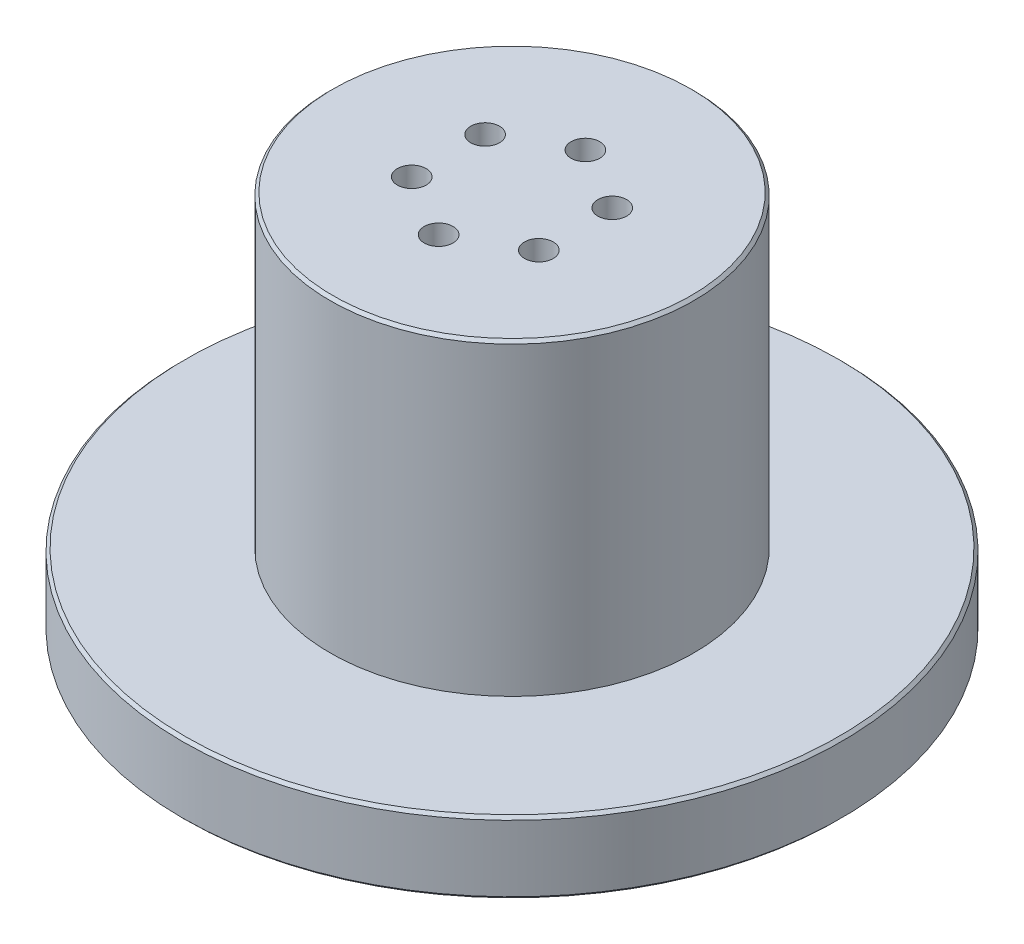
ISO-10303-21;
HEADER;
FILE_DESCRIPTION(('STEP AP214'),'2;1');
FILE_NAME('part.step','',(''),(''),'','','');
FILE_SCHEMA(('AUTOMOTIVE_DESIGN { 1 0 10303 214 1 1 1 1 }'));
ENDSEC;
DATA;
#1=APPLICATION_CONTEXT('core data for automotive mechanical design processes');
#2=APPLICATION_PROTOCOL_DEFINITION('international standard','automotive_design',2000,#1);
#3=PRODUCT_CONTEXT('',#1,'mechanical');
#4=PRODUCT('Part','Part','',(#3));
#5=PRODUCT_RELATED_PRODUCT_CATEGORY('part','',(#4));
#6=PRODUCT_DEFINITION_FORMATION('','',#4);
#7=PRODUCT_DEFINITION_CONTEXT('part definition',#1,'design');
#8=PRODUCT_DEFINITION('design','',#6,#7);
#9=PRODUCT_DEFINITION_SHAPE('','',#8);
#10=(LENGTH_UNIT() NAMED_UNIT(*) SI_UNIT(.MILLI.,.METRE.));
#11=(NAMED_UNIT(*) PLANE_ANGLE_UNIT() SI_UNIT($,.RADIAN.));
#12=(NAMED_UNIT(*) SI_UNIT($,.STERADIAN.) SOLID_ANGLE_UNIT());
#13=UNCERTAINTY_MEASURE_WITH_UNIT(LENGTH_MEASURE(1.E-05),#10,'distance_accuracy_value','');
#14=(GEOMETRIC_REPRESENTATION_CONTEXT(3) GLOBAL_UNCERTAINTY_ASSIGNED_CONTEXT((#13)) GLOBAL_UNIT_ASSIGNED_CONTEXT((#10,
#11,#12)) REPRESENTATION_CONTEXT('',''));
#15=CARTESIAN_POINT('',(0.,0.,0.));
#16=DIRECTION('',(0.,0.,1.));
#17=DIRECTION('',(1.,0.,0.));
#18=AXIS2_PLACEMENT_3D('',#15,#16,#17);
#19=CARTESIAN_POINT('',(0.,0.,0.));
#20=DIRECTION('',(0.,1.,0.));
#21=DIRECTION('',(0.,0.,1.));
#22=AXIS2_PLACEMENT_3D('',#19,#20,#21);
#23=PLANE('',#22);
#24=CARTESIAN_POINT('',(0.,0.,0.));
#25=DIRECTION('',(0.,1.,0.));
#26=DIRECTION('',(0.,0.,1.));
#27=AXIS2_PLACEMENT_3D('',#24,#25,#26);
#28=CIRCLE('',#27,56.75);
#29=CARTESIAN_POINT('',(0.,0.,56.75));
#30=VERTEX_POINT('',#29);
#31=EDGE_CURVE('E122',#30,#30,#28,.F.);
#32=ORIENTED_EDGE('',*,*,#31,.T.);
#33=EDGE_LOOP('',(#32));
#34=FACE_BOUND('',#33,.T.);
#35=ADVANCED_FACE('F38',(#34),#23,.F.);
#36=CARTESIAN_POINT('',(0.,-37.4668861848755,0.));
#37=DIRECTION('',(0.,-1.,0.));
#38=DIRECTION('',(0.,0.,-1.));
#39=AXIS2_PLACEMENT_3D('',#36,#37,#38);
#40=CYLINDRICAL_SURFACE('',#39,57.25);
#41=CARTESIAN_POINT('',(0.,12.,2.22044604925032E-13));
#42=DIRECTION('',(0.,-1.,0.));
#43=DIRECTION('',(0.,0.,-1.));
#44=AXIS2_PLACEMENT_3D('',#41,#42,#43);
#45=CIRCLE('',#44,57.25);
#46=CARTESIAN_POINT('',(0.,12.,-57.2499999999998));
#47=VERTEX_POINT('',#46);
#48=EDGE_CURVE('E116',#47,#47,#45,.T.);
#49=ORIENTED_EDGE('',*,*,#48,.T.);
#50=EDGE_LOOP('',(#49));
#51=FACE_BOUND('',#50,.T.);
#52=CARTESIAN_POINT('',(0.,0.5,0.));
#53=DIRECTION('',(0.,1.,0.));
#54=DIRECTION('',(0.,0.,1.));
#55=AXIS2_PLACEMENT_3D('',#52,#53,#54);
#56=CIRCLE('',#55,57.25);
#57=CARTESIAN_POINT('',(0.,0.5,57.25));
#58=VERTEX_POINT('',#57);
#59=EDGE_CURVE('E113',#58,#58,#56,.T.);
#60=ORIENTED_EDGE('',*,*,#59,.T.);
#61=EDGE_LOOP('',(#60));
#62=FACE_BOUND('',#61,.T.);
#63=ADVANCED_FACE('F140',(#51,#62),#40,.T.);
#64=CARTESIAN_POINT('',(-57.25,12.5,2.22044604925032E-13));
#65=DIRECTION('',(0.,-1.,0.));
#66=DIRECTION('',(0.,0.,-1.));
#67=AXIS2_PLACEMENT_3D('',#64,#65,#66);
#68=PLANE('',#67);
#69=CARTESIAN_POINT('',(0.,12.5,2.22044604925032E-13));
#70=DIRECTION('',(0.,-1.,0.));
#71=DIRECTION('',(0.,0.,-1.));
#72=AXIS2_PLACEMENT_3D('',#69,#70,#71);
#73=CIRCLE('',#72,56.75);
#74=CARTESIAN_POINT('',(0.,12.5,-56.7499999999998));
#75=VERTEX_POINT('',#74);
#76=EDGE_CURVE('E119',#75,#75,#73,.F.);
#77=ORIENTED_EDGE('',*,*,#76,.T.);
#78=EDGE_LOOP('',(#77));
#79=FACE_BOUND('',#78,.T.);
#80=CARTESIAN_POINT('',(0.,12.5,2.22044604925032E-13));
#81=DIRECTION('',(0.,-1.,0.));
#82=DIRECTION('',(0.,0.,-1.));
#83=AXIS2_PLACEMENT_3D('',#80,#81,#82);
#84=CIRCLE('',#83,31.6);
#85=CARTESIAN_POINT('',(0.,12.5,-31.5999999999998));
#86=VERTEX_POINT('',#85);
#87=EDGE_CURVE('E110',#86,#86,#84,.T.);
#88=ORIENTED_EDGE('',*,*,#87,.T.);
#89=EDGE_LOOP('',(#88));
#90=FACE_BOUND('',#89,.T.);
#91=ADVANCED_FACE('F146',(#79,#90),#68,.F.);
#92=CARTESIAN_POINT('',(0.,-37.4668861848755,0.));
#93=DIRECTION('',(0.,-1.,0.));
#94=DIRECTION('',(0.,0.,-1.));
#95=AXIS2_PLACEMENT_3D('',#92,#93,#94);
#96=CYLINDRICAL_SURFACE('',#95,31.6);
#97=CARTESIAN_POINT('',(0.,65.5,2.22044604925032E-13));
#98=DIRECTION('',(0.,-1.,0.));
#99=DIRECTION('',(0.,0.,-1.));
#100=AXIS2_PLACEMENT_3D('',#97,#98,#99);
#101=CIRCLE('',#100,31.6);
#102=CARTESIAN_POINT('',(0.,65.5,-31.5999999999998));
#103=VERTEX_POINT('',#102);
#104=EDGE_CURVE('E46',#103,#103,#101,.T.);
#105=ORIENTED_EDGE('',*,*,#104,.T.);
#106=EDGE_LOOP('',(#105));
#107=FACE_BOUND('',#106,.T.);
#108=ORIENTED_EDGE('',*,*,#87,.F.);
#109=EDGE_LOOP('',(#108));
#110=FACE_BOUND('',#109,.T.);
#111=ADVANCED_FACE('F127',(#107,#110),#96,.T.);
#112=CARTESIAN_POINT('',(-31.6,66.,2.22044604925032E-13));
#113=DIRECTION('',(0.,-1.,0.));
#114=DIRECTION('',(0.,0.,-1.));
#115=AXIS2_PLACEMENT_3D('',#112,#113,#114);
#116=PLANE('',#115);
#117=CARTESIAN_POINT('',(0.,66.,2.22044604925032E-13));
#118=DIRECTION('',(0.,-1.,0.));
#119=DIRECTION('',(0.,0.,-1.));
#120=AXIS2_PLACEMENT_3D('',#117,#118,#119);
#121=CIRCLE('',#120,31.1);
#122=CARTESIAN_POINT('',(0.,66.,-31.0999999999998));
#123=VERTEX_POINT('',#122);
#124=EDGE_CURVE('E11',#123,#123,#121,.F.);
#125=ORIENTED_EDGE('',*,*,#124,.T.);
#126=EDGE_LOOP('',(#125));
#127=FACE_BOUND('',#126,.T.);
#128=CARTESIAN_POINT('',(11.0418238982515,66.,6.37500000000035));
#129=DIRECTION('',(0.,1.,0.));
#130=DIRECTION('',(0.,0.,1.));
#131=AXIS2_PLACEMENT_3D('',#128,#129,#130);
#132=CIRCLE('',#131,2.49999999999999);
#133=CARTESIAN_POINT('',(11.0418238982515,66.,8.87500000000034));
#134=VERTEX_POINT('',#133);
#135=EDGE_CURVE('E76',#134,#134,#132,.T.);
#136=ORIENTED_EDGE('',*,*,#135,.F.);
#137=EDGE_LOOP('',(#136));
#138=FACE_BOUND('',#137,.T.);
#139=CARTESIAN_POINT('',(11.0418238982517,66.,-6.37499999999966));
#140=DIRECTION('',(0.,1.,0.));
#141=DIRECTION('',(0.,0.,1.));
#142=AXIS2_PLACEMENT_3D('',#139,#140,#141);
#143=CIRCLE('',#142,2.49999999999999);
#144=CARTESIAN_POINT('',(11.0418238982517,66.,-3.87499999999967));
#145=VERTEX_POINT('',#144);
#146=EDGE_CURVE('E75',#145,#145,#143,.T.);
#147=ORIENTED_EDGE('',*,*,#146,.F.);
#148=EDGE_LOOP('',(#147));
#149=FACE_BOUND('',#148,.T.);
#150=CARTESIAN_POINT('',(0.,65.9999999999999,-12.7499999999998));
#151=DIRECTION('',(0.,1.,0.));
#152=DIRECTION('',(0.,0.,1.));
#153=AXIS2_PLACEMENT_3D('',#150,#151,#152);
#154=CIRCLE('',#153,2.49999999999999);
#155=CARTESIAN_POINT('',(0.,65.9999999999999,-10.2499999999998));
#156=VERTEX_POINT('',#155);
#157=EDGE_CURVE('E86',#156,#156,#154,.T.);
#158=ORIENTED_EDGE('',*,*,#157,.F.);
#159=EDGE_LOOP('',(#158));
#160=FACE_BOUND('',#159,.T.);
#161=CARTESIAN_POINT('',(-11.0418238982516,66.,-6.37499999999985));
#162=DIRECTION('',(0.,1.,0.));
#163=DIRECTION('',(0.,0.,1.));
#164=AXIS2_PLACEMENT_3D('',#161,#162,#163);
#165=CIRCLE('',#164,2.49999999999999);
#166=CARTESIAN_POINT('',(-11.0418238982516,66.,-3.87499999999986));
#167=VERTEX_POINT('',#166);
#168=EDGE_CURVE('E92',#167,#167,#165,.T.);
#169=ORIENTED_EDGE('',*,*,#168,.F.);
#170=EDGE_LOOP('',(#169));
#171=FACE_BOUND('',#170,.T.);
#172=CARTESIAN_POINT('',(-11.0418238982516,66.,6.37500000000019));
#173=DIRECTION('',(0.,1.,0.));
#174=DIRECTION('',(0.,0.,1.));
#175=AXIS2_PLACEMENT_3D('',#172,#173,#174);
#176=CIRCLE('',#175,2.49999999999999);
#177=CARTESIAN_POINT('',(-11.0418238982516,66.,8.87500000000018));
#178=VERTEX_POINT('',#177);
#179=EDGE_CURVE('E98',#178,#178,#176,.T.);
#180=ORIENTED_EDGE('',*,*,#179,.F.);
#181=EDGE_LOOP('',(#180));
#182=FACE_BOUND('',#181,.T.);
#183=CARTESIAN_POINT('',(1.11022302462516E-13,66.0000000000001,12.7500000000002));
#184=DIRECTION('',(0.,1.,0.));
#185=DIRECTION('',(0.,0.,1.));
#186=AXIS2_PLACEMENT_3D('',#183,#184,#185);
#187=CIRCLE('',#186,2.49999999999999);
#188=CARTESIAN_POINT('',(1.11022302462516E-13,66.0000000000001,15.2500000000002));
#189=VERTEX_POINT('',#188);
#190=EDGE_CURVE('E104',#189,#189,#187,.T.);
#191=ORIENTED_EDGE('',*,*,#190,.F.);
#192=EDGE_LOOP('',(#191));
#193=FACE_BOUND('',#192,.T.);
#194=ADVANCED_FACE('F169',(#127,#138,#149,#160,#171,#182,#193),#116,.F.);
#195=CARTESIAN_POINT('',(0.,49.0000000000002,12.75));
#196=DIRECTION('',(0.,1.,0.));
#197=DIRECTION('',(0.,0.,1.));
#198=AXIS2_PLACEMENT_3D('',#195,#196,#197);
#199=CONICAL_SURFACE('',#198,2.49999999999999,1.02974425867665);
#200=CARTESIAN_POINT('',(0.,47.4978484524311,12.7500000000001));
#201=VERTEX_POINT('',#200);
#202=VERTEX_LOOP('',#201);
#203=FACE_BOUND('',#202,.T.);
#204=CARTESIAN_POINT('',(0.,49.0000000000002,12.75));
#205=DIRECTION('',(0.,1.,0.));
#206=DIRECTION('',(0.,0.,1.));
#207=AXIS2_PLACEMENT_3D('',#204,#205,#206);
#208=CIRCLE('',#207,2.49999999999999);
#209=CARTESIAN_POINT('',(0.,49.0000000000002,15.25));
#210=VERTEX_POINT('',#209);
#211=EDGE_CURVE('E107',#210,#210,#208,.T.);
#212=ORIENTED_EDGE('',*,*,#211,.T.);
#213=EDGE_LOOP('',(#212));
#214=FACE_BOUND('',#213,.T.);
#215=ADVANCED_FACE('F174',(#203,#214),#199,.F.);
#216=CARTESIAN_POINT('',(1.11022302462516E-13,66.0000000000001,12.7500000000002));
#217=DIRECTION('',(0.,1.,0.));
#218=DIRECTION('',(0.,0.,1.));
#219=AXIS2_PLACEMENT_3D('',#216,#217,#218);
#220=CYLINDRICAL_SURFACE('',#219,2.49999999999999);
#221=ORIENTED_EDGE('',*,*,#211,.F.);
#222=EDGE_LOOP('',(#221));
#223=FACE_BOUND('',#222,.T.);
#224=ORIENTED_EDGE('',*,*,#190,.T.);
#225=EDGE_LOOP('',(#224));
#226=FACE_BOUND('',#225,.T.);
#227=ADVANCED_FACE('F180',(#223,#226),#220,.F.);
#228=CARTESIAN_POINT('',(-11.0418238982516,49.0000000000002,6.37499999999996));
#229=DIRECTION('',(0.,1.,0.));
#230=DIRECTION('',(0.,0.,1.));
#231=AXIS2_PLACEMENT_3D('',#228,#229,#230);
#232=CONICAL_SURFACE('',#231,2.49999999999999,1.02974425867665);
#233=CARTESIAN_POINT('',(-11.0418238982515,47.4978484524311,6.37499999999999));
#234=VERTEX_POINT('',#233);
#235=VERTEX_LOOP('',#234);
#236=FACE_BOUND('',#235,.T.);
#237=CARTESIAN_POINT('',(-11.0418238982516,49.0000000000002,6.37499999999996));
#238=DIRECTION('',(0.,1.,0.));
#239=DIRECTION('',(0.,0.,1.));
#240=AXIS2_PLACEMENT_3D('',#237,#238,#239);
#241=CIRCLE('',#240,2.49999999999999);
#242=CARTESIAN_POINT('',(-11.0418238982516,49.0000000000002,8.87499999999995));
#243=VERTEX_POINT('',#242);
#244=EDGE_CURVE('E101',#243,#243,#241,.T.);
#245=ORIENTED_EDGE('',*,*,#244,.T.);
#246=EDGE_LOOP('',(#245));
#247=FACE_BOUND('',#246,.T.);
#248=ADVANCED_FACE('F183',(#236,#247),#232,.F.);
#249=CARTESIAN_POINT('',(-11.0418238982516,66.,6.37500000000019));
#250=DIRECTION('',(0.,1.,0.));
#251=DIRECTION('',(0.,0.,1.));
#252=AXIS2_PLACEMENT_3D('',#249,#250,#251);
#253=CYLINDRICAL_SURFACE('',#252,2.49999999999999);
#254=ORIENTED_EDGE('',*,*,#244,.F.);
#255=EDGE_LOOP('',(#254));
#256=FACE_BOUND('',#255,.T.);
#257=ORIENTED_EDGE('',*,*,#179,.T.);
#258=EDGE_LOOP('',(#257));
#259=FACE_BOUND('',#258,.T.);
#260=ADVANCED_FACE('F187',(#256,#259),#253,.F.);
#261=CARTESIAN_POINT('',(-11.0418238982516,49.,-6.37500000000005));
#262=DIRECTION('',(0.,1.,0.));
#263=DIRECTION('',(0.,0.,1.));
#264=AXIS2_PLACEMENT_3D('',#261,#262,#263);
#265=CONICAL_SURFACE('',#264,2.49999999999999,1.02974425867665);
#266=CARTESIAN_POINT('',(-11.0418238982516,47.497848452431,-6.37500000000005));
#267=VERTEX_POINT('',#266);
#268=VERTEX_LOOP('',#267);
#269=FACE_BOUND('',#268,.T.);
#270=CARTESIAN_POINT('',(-11.0418238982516,49.,-6.37500000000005));
#271=DIRECTION('',(0.,1.,0.));
#272=DIRECTION('',(0.,0.,1.));
#273=AXIS2_PLACEMENT_3D('',#270,#271,#272);
#274=CIRCLE('',#273,2.49999999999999);
#275=CARTESIAN_POINT('',(-11.0418238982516,49.,-3.87500000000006));
#276=VERTEX_POINT('',#275);
#277=EDGE_CURVE('E95',#276,#276,#274,.T.);
#278=ORIENTED_EDGE('',*,*,#277,.T.);
#279=EDGE_LOOP('',(#278));
#280=FACE_BOUND('',#279,.T.);
#281=ADVANCED_FACE('F190',(#269,#280),#265,.F.);
#282=CARTESIAN_POINT('',(-11.0418238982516,66.,-6.37499999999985));
#283=DIRECTION('',(0.,1.,0.));
#284=DIRECTION('',(0.,0.,1.));
#285=AXIS2_PLACEMENT_3D('',#282,#283,#284);
#286=CYLINDRICAL_SURFACE('',#285,2.49999999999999);
#287=ORIENTED_EDGE('',*,*,#277,.F.);
#288=EDGE_LOOP('',(#287));
#289=FACE_BOUND('',#288,.T.);
#290=ORIENTED_EDGE('',*,*,#168,.T.);
#291=EDGE_LOOP('',(#290));
#292=FACE_BOUND('',#291,.T.);
#293=ADVANCED_FACE('F194',(#289,#292),#286,.F.);
#294=CARTESIAN_POINT('',(1.11130722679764E-13,48.9999999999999,-12.75));
#295=DIRECTION('',(0.,1.,0.));
#296=DIRECTION('',(0.,0.,1.));
#297=AXIS2_PLACEMENT_3D('',#294,#295,#296);
#298=CONICAL_SURFACE('',#297,2.49999999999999,1.02974425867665);
#299=CARTESIAN_POINT('',(0.,47.4978484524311,-12.7499999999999));
#300=VERTEX_POINT('',#299);
#301=VERTEX_LOOP('',#300);
#302=FACE_BOUND('',#301,.T.);
#303=CARTESIAN_POINT('',(1.11130722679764E-13,48.9999999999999,-12.75));
#304=DIRECTION('',(0.,1.,0.));
#305=DIRECTION('',(0.,0.,1.));
#306=AXIS2_PLACEMENT_3D('',#303,#304,#305);
#307=CIRCLE('',#306,2.49999999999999);
#308=CARTESIAN_POINT('',(1.11130722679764E-13,48.9999999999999,-10.25));
#309=VERTEX_POINT('',#308);
#310=EDGE_CURVE('E89',#309,#309,#307,.T.);
#311=ORIENTED_EDGE('',*,*,#310,.T.);
#312=EDGE_LOOP('',(#311));
#313=FACE_BOUND('',#312,.T.);
#314=ADVANCED_FACE('F198',(#302,#313),#298,.F.);
#315=CARTESIAN_POINT('',(0.,65.9999999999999,-12.7499999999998));
#316=DIRECTION('',(0.,1.,0.));
#317=DIRECTION('',(0.,0.,1.));
#318=AXIS2_PLACEMENT_3D('',#315,#316,#317);
#319=CYLINDRICAL_SURFACE('',#318,2.49999999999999);
#320=ORIENTED_EDGE('',*,*,#310,.F.);
#321=EDGE_LOOP('',(#320));
#322=FACE_BOUND('',#321,.T.);
#323=ORIENTED_EDGE('',*,*,#157,.T.);
#324=EDGE_LOOP('',(#323));
#325=FACE_BOUND('',#324,.T.);
#326=ADVANCED_FACE('F202',(#322,#325),#319,.F.);
#327=CARTESIAN_POINT('',(11.0418238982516,48.9999999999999,-6.37499999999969));
#328=DIRECTION('',(0.,1.,0.));
#329=DIRECTION('',(0.,0.,1.));
#330=AXIS2_PLACEMENT_3D('',#327,#328,#329);
#331=CONICAL_SURFACE('',#330,2.49999999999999,1.02974425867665);
#332=CARTESIAN_POINT('',(11.0418238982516,47.497848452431,-6.37499999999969));
#333=VERTEX_POINT('',#332);
#334=VERTEX_LOOP('',#333);
#335=FACE_BOUND('',#334,.T.);
#336=CARTESIAN_POINT('',(11.0418238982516,48.9999999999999,-6.37499999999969));
#337=DIRECTION('',(0.,1.,0.));
#338=DIRECTION('',(0.,0.,1.));
#339=AXIS2_PLACEMENT_3D('',#336,#337,#338);
#340=CIRCLE('',#339,2.49999999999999);
#341=CARTESIAN_POINT('',(11.0418238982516,48.9999999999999,-3.8749999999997));
#342=VERTEX_POINT('',#341);
#343=EDGE_CURVE('E79',#342,#342,#340,.T.);
#344=ORIENTED_EDGE('',*,*,#343,.T.);
#345=EDGE_LOOP('',(#344));
#346=FACE_BOUND('',#345,.T.);
#347=ADVANCED_FACE('F206',(#335,#346),#331,.F.);
#348=CARTESIAN_POINT('',(11.0418238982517,66.,-6.37499999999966));
#349=DIRECTION('',(0.,1.,0.));
#350=DIRECTION('',(0.,0.,1.));
#351=AXIS2_PLACEMENT_3D('',#348,#349,#350);
#352=CYLINDRICAL_SURFACE('',#351,2.49999999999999);
#353=ORIENTED_EDGE('',*,*,#343,.F.);
#354=EDGE_LOOP('',(#353));
#355=FACE_BOUND('',#354,.T.);
#356=ORIENTED_EDGE('',*,*,#146,.T.);
#357=EDGE_LOOP('',(#356));
#358=FACE_BOUND('',#357,.T.);
#359=ADVANCED_FACE('F69',(#355,#358),#352,.F.);
#360=CARTESIAN_POINT('',(11.0418238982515,49.,6.37500000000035));
#361=DIRECTION('',(0.,1.,0.));
#362=DIRECTION('',(0.,0.,1.));
#363=AXIS2_PLACEMENT_3D('',#360,#361,#362);
#364=CONICAL_SURFACE('',#363,2.49999999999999,1.02974425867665);
#365=CARTESIAN_POINT('',(11.0418238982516,47.4978484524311,6.37500000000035));
#366=VERTEX_POINT('',#365);
#367=VERTEX_LOOP('',#366);
#368=FACE_BOUND('',#367,.T.);
#369=CARTESIAN_POINT('',(11.0418238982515,49.,6.37500000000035));
#370=DIRECTION('',(0.,1.,0.));
#371=DIRECTION('',(0.,0.,1.));
#372=AXIS2_PLACEMENT_3D('',#369,#370,#371);
#373=CIRCLE('',#372,2.49999999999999);
#374=CARTESIAN_POINT('',(11.0418238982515,49.,8.87500000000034));
#375=VERTEX_POINT('',#374);
#376=EDGE_CURVE('E73',#375,#375,#373,.T.);
#377=ORIENTED_EDGE('',*,*,#376,.T.);
#378=EDGE_LOOP('',(#377));
#379=FACE_BOUND('',#378,.T.);
#380=ADVANCED_FACE('F65',(#368,#379),#364,.F.);
#381=CARTESIAN_POINT('',(11.0418238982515,66.,6.37500000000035));
#382=DIRECTION('',(0.,1.,0.));
#383=DIRECTION('',(0.,0.,1.));
#384=AXIS2_PLACEMENT_3D('',#381,#382,#383);
#385=CYLINDRICAL_SURFACE('',#384,2.49999999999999);
#386=ORIENTED_EDGE('',*,*,#376,.F.);
#387=EDGE_LOOP('',(#386));
#388=FACE_BOUND('',#387,.T.);
#389=ORIENTED_EDGE('',*,*,#135,.T.);
#390=EDGE_LOOP('',(#389));
#391=FACE_BOUND('',#390,.T.);
#392=ADVANCED_FACE('F68',(#388,#391),#385,.F.);
#393=CARTESIAN_POINT('',(0.,12.,2.22044604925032E-13));
#394=DIRECTION('',(0.,-1.,0.));
#395=DIRECTION('',(0.,0.,-1.));
#396=AXIS2_PLACEMENT_3D('',#393,#394,#395);
#397=CONICAL_SURFACE('',#396,57.25,0.785398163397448);
#398=ORIENTED_EDGE('',*,*,#76,.F.);
#399=EDGE_LOOP('',(#398));
#400=FACE_BOUND('',#399,.T.);
#401=ORIENTED_EDGE('',*,*,#48,.F.);
#402=EDGE_LOOP('',(#401));
#403=FACE_BOUND('',#402,.T.);
#404=ADVANCED_FACE('F136',(#400,#403),#397,.T.);
#405=CARTESIAN_POINT('',(0.,0.,0.));
#406=DIRECTION('',(0.,1.,0.));
#407=DIRECTION('',(0.,0.,1.));
#408=AXIS2_PLACEMENT_3D('',#405,#406,#407);
#409=CONICAL_SURFACE('',#408,56.75,0.785398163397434);
#410=ORIENTED_EDGE('',*,*,#59,.F.);
#411=EDGE_LOOP('',(#410));
#412=FACE_BOUND('',#411,.T.);
#413=ORIENTED_EDGE('',*,*,#31,.F.);
#414=EDGE_LOOP('',(#413));
#415=FACE_BOUND('',#414,.T.);
#416=ADVANCED_FACE('F131',(#412,#415),#409,.T.);
#417=CARTESIAN_POINT('',(0.,65.5,2.22044604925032E-13));
#418=DIRECTION('',(0.,-1.,0.));
#419=DIRECTION('',(0.,0.,-1.));
#420=AXIS2_PLACEMENT_3D('',#417,#418,#419);
#421=CONICAL_SURFACE('',#420,31.6,0.785398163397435);
#422=ORIENTED_EDGE('',*,*,#124,.F.);
#423=EDGE_LOOP('',(#422));
#424=FACE_BOUND('',#423,.T.);
#425=ORIENTED_EDGE('',*,*,#104,.F.);
#426=EDGE_LOOP('',(#425));
#427=FACE_BOUND('',#426,.T.);
#428=ADVANCED_FACE('F40',(#424,#427),#421,.T.);
#429=CLOSED_SHELL('',(#35,#63,#91,#111,#194,#215,#227,#248,#260,#281,#293,#314,#326,#347,#359,
#380,#392,#404,#416,#428));
#430=MANIFOLD_SOLID_BREP('B2',#429);
#431=ADVANCED_BREP_SHAPE_REPRESENTATION('',(#18,#430),#14);
#432=SHAPE_DEFINITION_REPRESENTATION(#9,#431);
ENDSEC;
END-ISO-10303-21;
